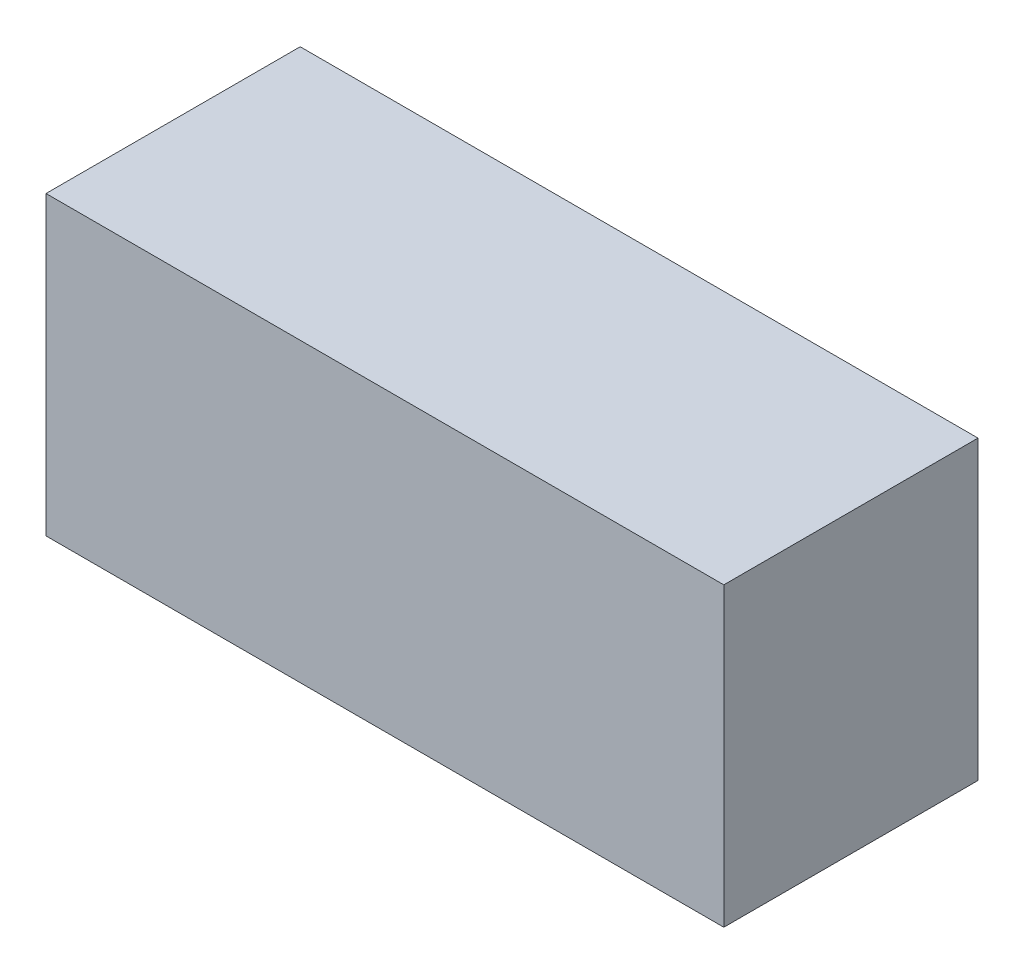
from build123d import *

# Parameters (mm, degrees)
ESQUISSE1_W        = 80
ESQUISSE1_H        = 35
BOSS_EXTRU_1_DEPTH = 15


with BuildPart() as part:
    # Esquisse1 → Boss.-Extru.1 (new, symmetric)
    with BuildSketch(Plane.XY):
        with Locations((40, 17.5)):
            Rectangle(ESQUISSE1_W, ESQUISSE1_H)
    extrude(amount=BOSS_EXTRU_1_DEPTH, both=True)


solid = part.part
